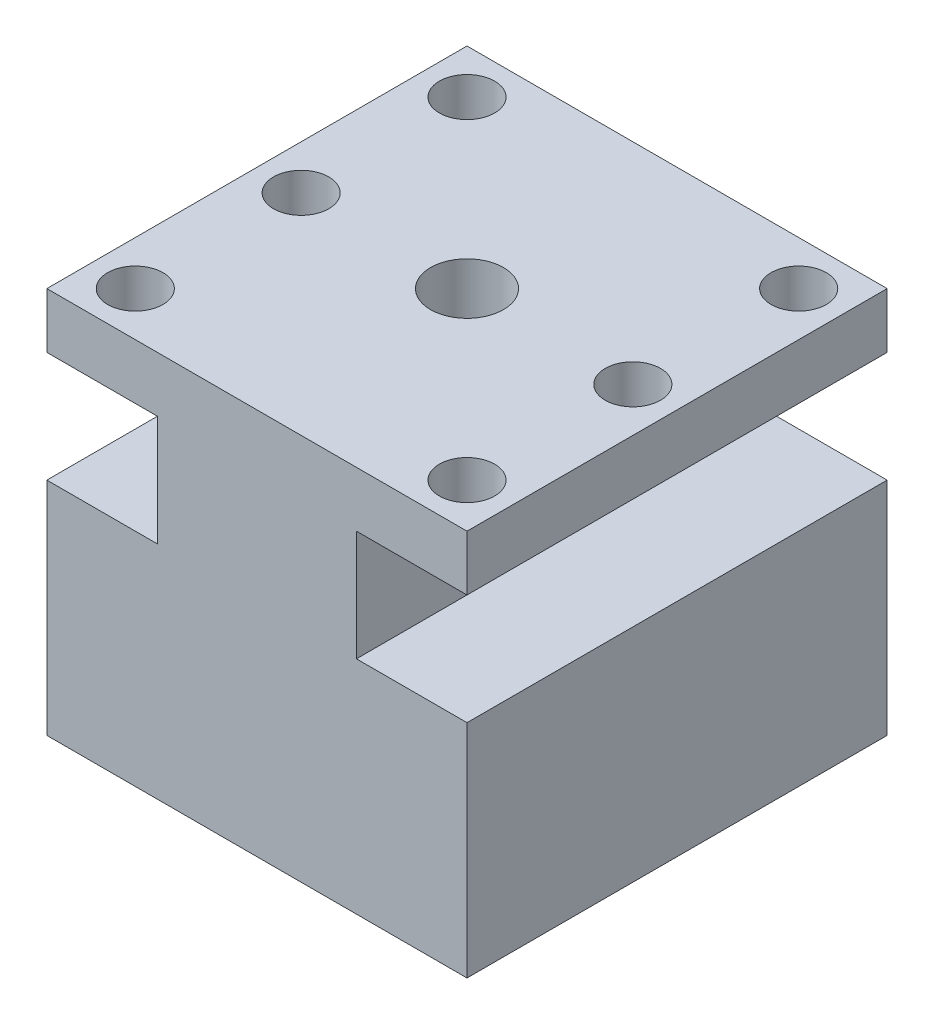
ISO-10303-21;
HEADER;
FILE_DESCRIPTION(('STEP AP214'),'2;1');
FILE_NAME('part.step','',(''),(''),'','','');
FILE_SCHEMA(('AUTOMOTIVE_DESIGN { 1 0 10303 214 1 1 1 1 }'));
ENDSEC;
DATA;
#1=APPLICATION_CONTEXT('core data for automotive mechanical design processes');
#2=APPLICATION_PROTOCOL_DEFINITION('international standard','automotive_design',2000,#1);
#3=PRODUCT_CONTEXT('',#1,'mechanical');
#4=PRODUCT('Part','Part','',(#3));
#5=PRODUCT_RELATED_PRODUCT_CATEGORY('part','',(#4));
#6=PRODUCT_DEFINITION_FORMATION('','',#4);
#7=PRODUCT_DEFINITION_CONTEXT('part definition',#1,'design');
#8=PRODUCT_DEFINITION('design','',#6,#7);
#9=PRODUCT_DEFINITION_SHAPE('','',#8);
#10=(LENGTH_UNIT() NAMED_UNIT(*) SI_UNIT(.MILLI.,.METRE.));
#11=(NAMED_UNIT(*) PLANE_ANGLE_UNIT() SI_UNIT($,.RADIAN.));
#12=(NAMED_UNIT(*) SI_UNIT($,.STERADIAN.) SOLID_ANGLE_UNIT());
#13=UNCERTAINTY_MEASURE_WITH_UNIT(LENGTH_MEASURE(1.E-05),#10,'distance_accuracy_value','');
#14=(GEOMETRIC_REPRESENTATION_CONTEXT(3) GLOBAL_UNCERTAINTY_ASSIGNED_CONTEXT((#13)) GLOBAL_UNIT_ASSIGNED_CONTEXT((#10,
#11,#12)) REPRESENTATION_CONTEXT('',''));
#15=CARTESIAN_POINT('',(0.,0.,0.));
#16=DIRECTION('',(0.,0.,1.));
#17=DIRECTION('',(1.,0.,0.));
#18=AXIS2_PLACEMENT_3D('',#15,#16,#17);
#19=CARTESIAN_POINT('',(0.,20.,0.));
#20=DIRECTION('',(0.,-1.,0.));
#21=DIRECTION('',(0.,0.,-1.));
#22=AXIS2_PLACEMENT_3D('',#19,#20,#21);
#23=PLANE('',#22);
#24=DIRECTION('',(0.,0.,-1.));
#25=VECTOR('',#24,1.);
#26=CARTESIAN_POINT('',(9.,20.,-19.));
#27=LINE('',#26,#25);
#28=CARTESIAN_POINT('',(9.,20.,19.));
#29=VERTEX_POINT('',#28);
#30=CARTESIAN_POINT('',(9.,20.,-19.));
#31=VERTEX_POINT('',#30);
#32=EDGE_CURVE('E58',#29,#31,#27,.T.);
#33=ORIENTED_EDGE('',*,*,#32,.F.);
#34=DIRECTION('',(1.,0.,0.));
#35=VECTOR('',#34,1.);
#36=CARTESIAN_POINT('',(-19.,20.,19.));
#37=LINE('',#36,#35);
#38=CARTESIAN_POINT('',(19.,20.,19.));
#39=VERTEX_POINT('',#38);
#40=EDGE_CURVE('E193',#29,#39,#37,.T.);
#41=ORIENTED_EDGE('',*,*,#40,.T.);
#42=DIRECTION('',(0.,0.,-1.));
#43=VECTOR('',#42,1.);
#44=CARTESIAN_POINT('',(19.,20.,19.));
#45=LINE('',#44,#43);
#46=CARTESIAN_POINT('',(19.,20.,-19.));
#47=VERTEX_POINT('',#46);
#48=EDGE_CURVE('E184',#39,#47,#45,.T.);
#49=ORIENTED_EDGE('',*,*,#48,.T.);
#50=DIRECTION('',(-1.,0.,0.));
#51=VECTOR('',#50,1.);
#52=CARTESIAN_POINT('',(-19.,20.,-19.));
#53=LINE('',#52,#51);
#54=EDGE_CURVE('E189',#47,#31,#53,.T.);
#55=ORIENTED_EDGE('',*,*,#54,.T.);
#56=EDGE_LOOP('',(#33,#41,#49,#55));
#57=FACE_BOUND('',#56,.T.);
#58=ADVANCED_FACE('F43',(#57),#23,.F.);
#59=DIRECTION('',(0.,0.,1.));
#60=VECTOR('',#59,1.);
#61=CARTESIAN_POINT('',(-9.,20.,-19.));
#62=LINE('',#61,#60);
#63=CARTESIAN_POINT('',(-9.,20.,-19.));
#64=VERTEX_POINT('',#63);
#65=CARTESIAN_POINT('',(-9.,20.,19.));
#66=VERTEX_POINT('',#65);
#67=EDGE_CURVE('E66',#64,#66,#62,.T.);
#68=ORIENTED_EDGE('',*,*,#67,.F.);
#69=CARTESIAN_POINT('',(-19.,20.,-19.));
#70=VERTEX_POINT('',#69);
#71=EDGE_CURVE('E187',#64,#70,#53,.T.);
#72=ORIENTED_EDGE('',*,*,#71,.T.);
#73=DIRECTION('',(0.,0.,1.));
#74=VECTOR('',#73,1.);
#75=CARTESIAN_POINT('',(-19.,20.,19.));
#76=LINE('',#75,#74);
#77=CARTESIAN_POINT('',(-19.,20.,19.));
#78=VERTEX_POINT('',#77);
#79=EDGE_CURVE('E191',#70,#78,#76,.T.);
#80=ORIENTED_EDGE('',*,*,#79,.T.);
#81=EDGE_CURVE('E194',#78,#66,#37,.T.);
#82=ORIENTED_EDGE('',*,*,#81,.T.);
#83=EDGE_LOOP('',(#68,#72,#80,#82));
#84=FACE_BOUND('',#83,.T.);
#85=ADVANCED_FACE('F253',(#84),#23,.F.);
#86=CARTESIAN_POINT('',(19.,20.,19.));
#87=DIRECTION('',(-1.,0.,0.));
#88=DIRECTION('',(0.,0.,1.));
#89=AXIS2_PLACEMENT_3D('',#86,#87,#88);
#90=PLANE('',#89);
#91=DIRECTION('',(0.,0.,-1.));
#92=VECTOR('',#91,1.);
#93=CARTESIAN_POINT('',(19.,0.,19.));
#94=LINE('',#93,#92);
#95=CARTESIAN_POINT('',(19.,0.,19.));
#96=VERTEX_POINT('',#95);
#97=CARTESIAN_POINT('',(19.,0.,-19.));
#98=VERTEX_POINT('',#97);
#99=EDGE_CURVE('E183',#96,#98,#94,.T.);
#100=ORIENTED_EDGE('',*,*,#99,.T.);
#101=DIRECTION('',(0.,-1.,0.));
#102=VECTOR('',#101,1.);
#103=CARTESIAN_POINT('',(19.,20.,-19.));
#104=LINE('',#103,#102);
#105=EDGE_CURVE('E11',#47,#98,#104,.T.);
#106=ORIENTED_EDGE('',*,*,#105,.F.);
#107=ORIENTED_EDGE('',*,*,#48,.F.);
#108=DIRECTION('',(0.,-1.,0.));
#109=VECTOR('',#108,1.);
#110=CARTESIAN_POINT('',(19.,20.,19.));
#111=LINE('',#110,#109);
#112=EDGE_CURVE('E196',#39,#96,#111,.T.);
#113=ORIENTED_EDGE('',*,*,#112,.T.);
#114=EDGE_LOOP('',(#100,#106,#107,#113));
#115=FACE_BOUND('',#114,.T.);
#116=ADVANCED_FACE('F45',(#115),#90,.F.);
#117=CARTESIAN_POINT('',(-19.,20.,-19.));
#118=DIRECTION('',(0.,0.,1.));
#119=DIRECTION('',(1.,0.,0.));
#120=AXIS2_PLACEMENT_3D('',#117,#118,#119);
#121=PLANE('',#120);
#122=DIRECTION('',(-1.,0.,0.));
#123=VECTOR('',#122,1.);
#124=CARTESIAN_POINT('',(-19.,0.,-19.));
#125=LINE('',#124,#123);
#126=CARTESIAN_POINT('',(-19.,0.,-19.));
#127=VERTEX_POINT('',#126);
#128=EDGE_CURVE('E199',#98,#127,#125,.T.);
#129=ORIENTED_EDGE('',*,*,#128,.T.);
#130=DIRECTION('',(0.,-1.,0.));
#131=VECTOR('',#130,1.);
#132=CARTESIAN_POINT('',(-19.,20.,-19.));
#133=LINE('',#132,#131);
#134=EDGE_CURVE('E51',#70,#127,#133,.T.);
#135=ORIENTED_EDGE('',*,*,#134,.F.);
#136=ORIENTED_EDGE('',*,*,#71,.F.);
#137=DIRECTION('',(0.,-1.,0.));
#138=VECTOR('',#137,1.);
#139=CARTESIAN_POINT('',(-9.,30.,-19.));
#140=LINE('',#139,#138);
#141=CARTESIAN_POINT('',(-9.,30.,-19.));
#142=VERTEX_POINT('',#141);
#143=EDGE_CURVE('E177',#142,#64,#140,.T.);
#144=ORIENTED_EDGE('',*,*,#143,.F.);
#145=DIRECTION('',(-1.,0.,0.));
#146=VECTOR('',#145,1.);
#147=CARTESIAN_POINT('',(-19.,30.,-19.));
#148=LINE('',#147,#146);
#149=CARTESIAN_POINT('',(-19.,30.,-19.));
#150=VERTEX_POINT('',#149);
#151=EDGE_CURVE('E250',#142,#150,#148,.T.);
#152=ORIENTED_EDGE('',*,*,#151,.T.);
#153=DIRECTION('',(0.,-1.,0.));
#154=VECTOR('',#153,1.);
#155=CARTESIAN_POINT('',(-19.,35.,-19.));
#156=LINE('',#155,#154);
#157=CARTESIAN_POINT('',(-19.,35.,-19.));
#158=VERTEX_POINT('',#157);
#159=EDGE_CURVE('E140',#158,#150,#156,.T.);
#160=ORIENTED_EDGE('',*,*,#159,.F.);
#161=DIRECTION('',(-1.,0.,0.));
#162=VECTOR('',#161,1.);
#163=CARTESIAN_POINT('',(-19.,35.,-19.));
#164=LINE('',#163,#162);
#165=CARTESIAN_POINT('',(19.,35.,-19.));
#166=VERTEX_POINT('',#165);
#167=EDGE_CURVE('E132',#166,#158,#164,.T.);
#168=ORIENTED_EDGE('',*,*,#167,.F.);
#169=DIRECTION('',(0.,-1.,0.));
#170=VECTOR('',#169,1.);
#171=CARTESIAN_POINT('',(19.,35.,-19.));
#172=LINE('',#171,#170);
#173=CARTESIAN_POINT('',(19.,30.,-19.));
#174=VERTEX_POINT('',#173);
#175=EDGE_CURVE('E137',#166,#174,#172,.T.);
#176=ORIENTED_EDGE('',*,*,#175,.T.);
#177=CARTESIAN_POINT('',(9.,30.,-19.));
#178=VERTEX_POINT('',#177);
#179=EDGE_CURVE('E236',#174,#178,#148,.T.);
#180=ORIENTED_EDGE('',*,*,#179,.T.);
#181=DIRECTION('',(0.,-1.,0.));
#182=VECTOR('',#181,1.);
#183=CARTESIAN_POINT('',(9.,30.,-19.));
#184=LINE('',#183,#182);
#185=EDGE_CURVE('E180',#178,#31,#184,.T.);
#186=ORIENTED_EDGE('',*,*,#185,.T.);
#187=ORIENTED_EDGE('',*,*,#54,.F.);
#188=ORIENTED_EDGE('',*,*,#105,.T.);
#189=EDGE_LOOP('',(#129,#135,#136,#144,#152,#160,#168,#176,#180,#186,#187,#188));
#190=FACE_BOUND('',#189,.T.);
#191=ADVANCED_FACE('F134',(#190),#121,.F.);
#192=CARTESIAN_POINT('',(-19.,20.,19.));
#193=DIRECTION('',(1.,0.,0.));
#194=DIRECTION('',(0.,0.,-1.));
#195=AXIS2_PLACEMENT_3D('',#192,#193,#194);
#196=PLANE('',#195);
#197=DIRECTION('',(0.,0.,1.));
#198=VECTOR('',#197,1.);
#199=CARTESIAN_POINT('',(-19.,0.,19.));
#200=LINE('',#199,#198);
#201=CARTESIAN_POINT('',(-19.,0.,19.));
#202=VERTEX_POINT('',#201);
#203=EDGE_CURVE('E201',#127,#202,#200,.T.);
#204=ORIENTED_EDGE('',*,*,#203,.T.);
#205=DIRECTION('',(0.,-1.,0.));
#206=VECTOR('',#205,1.);
#207=CARTESIAN_POINT('',(-19.,20.,19.));
#208=LINE('',#207,#206);
#209=EDGE_CURVE('E206',#78,#202,#208,.T.);
#210=ORIENTED_EDGE('',*,*,#209,.F.);
#211=ORIENTED_EDGE('',*,*,#79,.F.);
#212=ORIENTED_EDGE('',*,*,#134,.T.);
#213=EDGE_LOOP('',(#204,#210,#211,#212));
#214=FACE_BOUND('',#213,.T.);
#215=ADVANCED_FACE('F213',(#214),#196,.F.);
#216=CARTESIAN_POINT('',(-19.,20.,19.));
#217=DIRECTION('',(0.,0.,-1.));
#218=DIRECTION('',(-1.,0.,0.));
#219=AXIS2_PLACEMENT_3D('',#216,#217,#218);
#220=PLANE('',#219);
#221=DIRECTION('',(1.,0.,0.));
#222=VECTOR('',#221,1.);
#223=CARTESIAN_POINT('',(-19.,0.,19.));
#224=LINE('',#223,#222);
#225=EDGE_CURVE('E188',#202,#96,#224,.T.);
#226=ORIENTED_EDGE('',*,*,#225,.T.);
#227=ORIENTED_EDGE('',*,*,#112,.F.);
#228=ORIENTED_EDGE('',*,*,#40,.F.);
#229=DIRECTION('',(0.,-1.,0.));
#230=VECTOR('',#229,1.);
#231=CARTESIAN_POINT('',(9.,30.,19.));
#232=LINE('',#231,#230);
#233=CARTESIAN_POINT('',(9.,30.,19.));
#234=VERTEX_POINT('',#233);
#235=EDGE_CURVE('E169',#234,#29,#232,.T.);
#236=ORIENTED_EDGE('',*,*,#235,.F.);
#237=DIRECTION('',(1.,0.,0.));
#238=VECTOR('',#237,1.);
#239=CARTESIAN_POINT('',(-19.,30.,19.));
#240=LINE('',#239,#238);
#241=CARTESIAN_POINT('',(19.,30.,19.));
#242=VERTEX_POINT('',#241);
#243=EDGE_CURVE('E231',#234,#242,#240,.T.);
#244=ORIENTED_EDGE('',*,*,#243,.T.);
#245=DIRECTION('',(0.,-1.,0.));
#246=VECTOR('',#245,1.);
#247=CARTESIAN_POINT('',(19.,35.,19.));
#248=LINE('',#247,#246);
#249=CARTESIAN_POINT('',(19.,35.,19.));
#250=VERTEX_POINT('',#249);
#251=EDGE_CURVE('E240',#250,#242,#248,.T.);
#252=ORIENTED_EDGE('',*,*,#251,.F.);
#253=DIRECTION('',(1.,0.,0.));
#254=VECTOR('',#253,1.);
#255=CARTESIAN_POINT('',(-19.,35.,19.));
#256=LINE('',#255,#254);
#257=CARTESIAN_POINT('',(-19.,35.,19.));
#258=VERTEX_POINT('',#257);
#259=EDGE_CURVE('E149',#258,#250,#256,.T.);
#260=ORIENTED_EDGE('',*,*,#259,.F.);
#261=DIRECTION('',(0.,-1.,0.));
#262=VECTOR('',#261,1.);
#263=CARTESIAN_POINT('',(-19.,35.,19.));
#264=LINE('',#263,#262);
#265=CARTESIAN_POINT('',(-19.,30.,19.));
#266=VERTEX_POINT('',#265);
#267=EDGE_CURVE('E160',#258,#266,#264,.T.);
#268=ORIENTED_EDGE('',*,*,#267,.T.);
#269=CARTESIAN_POINT('',(-9.,30.,19.));
#270=VERTEX_POINT('',#269);
#271=EDGE_CURVE('E153',#266,#270,#240,.T.);
#272=ORIENTED_EDGE('',*,*,#271,.T.);
#273=DIRECTION('',(0.,-1.,0.));
#274=VECTOR('',#273,1.);
#275=CARTESIAN_POINT('',(-9.,30.,19.));
#276=LINE('',#275,#274);
#277=EDGE_CURVE('E174',#270,#66,#276,.T.);
#278=ORIENTED_EDGE('',*,*,#277,.T.);
#279=ORIENTED_EDGE('',*,*,#81,.F.);
#280=ORIENTED_EDGE('',*,*,#209,.T.);
#281=EDGE_LOOP('',(#226,#227,#228,#236,#244,#252,#260,#268,#272,#278,#279,#280));
#282=FACE_BOUND('',#281,.T.);
#283=ADVANCED_FACE('F221',(#282),#220,.F.);
#284=CARTESIAN_POINT('',(0.,0.,0.));
#285=DIRECTION('',(0.,-1.,0.));
#286=DIRECTION('',(0.,0.,-1.));
#287=AXIS2_PLACEMENT_3D('',#284,#285,#286);
#288=PLANE('',#287);
#289=CARTESIAN_POINT('',(0.,0.,0.));
#290=DIRECTION('',(0.,1.,0.));
#291=DIRECTION('',(0.,0.,1.));
#292=AXIS2_PLACEMENT_3D('',#289,#290,#291);
#293=CIRCLE('',#292,3.3);
#294=CARTESIAN_POINT('',(0.,0.,3.3));
#295=VERTEX_POINT('',#294);
#296=EDGE_CURVE('E297',#295,#295,#293,.T.);
#297=ORIENTED_EDGE('',*,*,#296,.T.);
#298=EDGE_LOOP('',(#297));
#299=FACE_BOUND('',#298,.T.);
#300=ORIENTED_EDGE('',*,*,#99,.F.);
#301=ORIENTED_EDGE('',*,*,#225,.F.);
#302=ORIENTED_EDGE('',*,*,#203,.F.);
#303=ORIENTED_EDGE('',*,*,#128,.F.);
#304=EDGE_LOOP('',(#300,#301,#302,#303));
#305=FACE_BOUND('',#304,.T.);
#306=ADVANCED_FACE('F218',(#299,#305),#288,.T.);
#307=CARTESIAN_POINT('',(9.,30.,-19.));
#308=DIRECTION('',(-1.,0.,0.));
#309=DIRECTION('',(0.,0.,1.));
#310=AXIS2_PLACEMENT_3D('',#307,#308,#309);
#311=PLANE('',#310);
#312=ORIENTED_EDGE('',*,*,#32,.T.);
#313=ORIENTED_EDGE('',*,*,#185,.F.);
#314=DIRECTION('',(0.,0.,-1.));
#315=VECTOR('',#314,1.);
#316=CARTESIAN_POINT('',(9.,30.,-19.));
#317=LINE('',#316,#315);
#318=EDGE_CURVE('E164',#234,#178,#317,.T.);
#319=ORIENTED_EDGE('',*,*,#318,.F.);
#320=ORIENTED_EDGE('',*,*,#235,.T.);
#321=EDGE_LOOP('',(#312,#313,#319,#320));
#322=FACE_BOUND('',#321,.T.);
#323=ADVANCED_FACE('F228',(#322),#311,.F.);
#324=CARTESIAN_POINT('',(-9.,30.,-19.));
#325=DIRECTION('',(1.,0.,0.));
#326=DIRECTION('',(0.,0.,-1.));
#327=AXIS2_PLACEMENT_3D('',#324,#325,#326);
#328=PLANE('',#327);
#329=ORIENTED_EDGE('',*,*,#67,.T.);
#330=ORIENTED_EDGE('',*,*,#277,.F.);
#331=DIRECTION('',(0.,0.,1.));
#332=VECTOR('',#331,1.);
#333=CARTESIAN_POINT('',(-9.,30.,-19.));
#334=LINE('',#333,#332);
#335=EDGE_CURVE('E167',#142,#270,#334,.T.);
#336=ORIENTED_EDGE('',*,*,#335,.F.);
#337=ORIENTED_EDGE('',*,*,#143,.T.);
#338=EDGE_LOOP('',(#329,#330,#336,#337));
#339=FACE_BOUND('',#338,.T.);
#340=ADVANCED_FACE('F252',(#339),#328,.F.);
#341=CARTESIAN_POINT('',(0.,30.,0.));
#342=DIRECTION('',(0.,1.,0.));
#343=DIRECTION('',(0.,0.,1.));
#344=AXIS2_PLACEMENT_3D('',#341,#342,#343);
#345=PLANE('',#344);
#346=CARTESIAN_POINT('',(15.,30.,-15.));
#347=DIRECTION('',(0.,1.,0.));
#348=DIRECTION('',(0.,0.,1.));
#349=AXIS2_PLACEMENT_3D('',#346,#347,#348);
#350=CIRCLE('',#349,2.5);
#351=CARTESIAN_POINT('',(15.,30.,-12.5));
#352=VERTEX_POINT('',#351);
#353=EDGE_CURVE('E273',#352,#352,#350,.T.);
#354=ORIENTED_EDGE('',*,*,#353,.T.);
#355=EDGE_LOOP('',(#354));
#356=FACE_BOUND('',#355,.T.);
#357=CARTESIAN_POINT('',(15.,30.,0.));
#358=DIRECTION('',(0.,1.,0.));
#359=DIRECTION('',(0.,0.,1.));
#360=AXIS2_PLACEMENT_3D('',#357,#358,#359);
#361=CIRCLE('',#360,2.5);
#362=CARTESIAN_POINT('',(15.,30.,2.5));
#363=VERTEX_POINT('',#362);
#364=EDGE_CURVE('E265',#363,#363,#361,.T.);
#365=ORIENTED_EDGE('',*,*,#364,.T.);
#366=EDGE_LOOP('',(#365));
#367=FACE_BOUND('',#366,.T.);
#368=CARTESIAN_POINT('',(15.,30.,15.));
#369=DIRECTION('',(0.,1.,0.));
#370=DIRECTION('',(0.,0.,1.));
#371=AXIS2_PLACEMENT_3D('',#368,#369,#370);
#372=CIRCLE('',#371,2.5);
#373=CARTESIAN_POINT('',(15.,30.,17.5));
#374=VERTEX_POINT('',#373);
#375=EDGE_CURVE('E258',#374,#374,#372,.T.);
#376=ORIENTED_EDGE('',*,*,#375,.T.);
#377=EDGE_LOOP('',(#376));
#378=FACE_BOUND('',#377,.T.);
#379=ORIENTED_EDGE('',*,*,#243,.F.);
#380=ORIENTED_EDGE('',*,*,#318,.T.);
#381=ORIENTED_EDGE('',*,*,#179,.F.);
#382=DIRECTION('',(0.,0.,-1.));
#383=VECTOR('',#382,1.);
#384=CARTESIAN_POINT('',(19.,30.,-19.));
#385=LINE('',#384,#383);
#386=EDGE_CURVE('E157',#242,#174,#385,.T.);
#387=ORIENTED_EDGE('',*,*,#386,.F.);
#388=EDGE_LOOP('',(#379,#380,#381,#387));
#389=FACE_BOUND('',#388,.T.);
#390=ADVANCED_FACE('F232',(#356,#367,#378,#389),#345,.F.);
#391=CARTESIAN_POINT('',(-15.,30.,-15.));
#392=DIRECTION('',(0.,1.,0.));
#393=DIRECTION('',(0.,0.,1.));
#394=AXIS2_PLACEMENT_3D('',#391,#392,#393);
#395=CIRCLE('',#394,2.5);
#396=CARTESIAN_POINT('',(-15.,30.,-12.5));
#397=VERTEX_POINT('',#396);
#398=EDGE_CURVE('E291',#397,#397,#395,.T.);
#399=ORIENTED_EDGE('',*,*,#398,.T.);
#400=EDGE_LOOP('',(#399));
#401=FACE_BOUND('',#400,.T.);
#402=CARTESIAN_POINT('',(-15.,30.,0.));
#403=DIRECTION('',(0.,1.,0.));
#404=DIRECTION('',(0.,0.,1.));
#405=AXIS2_PLACEMENT_3D('',#402,#403,#404);
#406=CIRCLE('',#405,2.5);
#407=CARTESIAN_POINT('',(-15.,30.,2.5));
#408=VERTEX_POINT('',#407);
#409=EDGE_CURVE('E285',#408,#408,#406,.T.);
#410=ORIENTED_EDGE('',*,*,#409,.T.);
#411=EDGE_LOOP('',(#410));
#412=FACE_BOUND('',#411,.T.);
#413=CARTESIAN_POINT('',(-15.,30.,15.));
#414=DIRECTION('',(0.,1.,0.));
#415=DIRECTION('',(0.,0.,1.));
#416=AXIS2_PLACEMENT_3D('',#413,#414,#415);
#417=CIRCLE('',#416,2.5);
#418=CARTESIAN_POINT('',(-15.,30.,17.5));
#419=VERTEX_POINT('',#418);
#420=EDGE_CURVE('E279',#419,#419,#417,.T.);
#421=ORIENTED_EDGE('',*,*,#420,.T.);
#422=EDGE_LOOP('',(#421));
#423=FACE_BOUND('',#422,.T.);
#424=ORIENTED_EDGE('',*,*,#151,.F.);
#425=ORIENTED_EDGE('',*,*,#335,.T.);
#426=ORIENTED_EDGE('',*,*,#271,.F.);
#427=DIRECTION('',(0.,0.,1.));
#428=VECTOR('',#427,1.);
#429=CARTESIAN_POINT('',(-19.,30.,-19.));
#430=LINE('',#429,#428);
#431=EDGE_CURVE('E233',#150,#266,#430,.T.);
#432=ORIENTED_EDGE('',*,*,#431,.F.);
#433=EDGE_LOOP('',(#424,#425,#426,#432));
#434=FACE_BOUND('',#433,.T.);
#435=ADVANCED_FACE('F248',(#401,#412,#423,#434),#345,.F.);
#436=CARTESIAN_POINT('',(19.,35.,-19.));
#437=DIRECTION('',(-1.,0.,0.));
#438=DIRECTION('',(0.,0.,1.));
#439=AXIS2_PLACEMENT_3D('',#436,#437,#438);
#440=PLANE('',#439);
#441=ORIENTED_EDGE('',*,*,#386,.T.);
#442=ORIENTED_EDGE('',*,*,#175,.F.);
#443=DIRECTION('',(0.,0.,-1.));
#444=VECTOR('',#443,1.);
#445=CARTESIAN_POINT('',(19.,35.,-19.));
#446=LINE('',#445,#444);
#447=EDGE_CURVE('E144',#250,#166,#446,.T.);
#448=ORIENTED_EDGE('',*,*,#447,.F.);
#449=ORIENTED_EDGE('',*,*,#251,.T.);
#450=EDGE_LOOP('',(#441,#442,#448,#449));
#451=FACE_BOUND('',#450,.T.);
#452=ADVANCED_FACE('F155',(#451),#440,.F.);
#453=CARTESIAN_POINT('',(-19.,35.,-19.));
#454=DIRECTION('',(1.,0.,0.));
#455=DIRECTION('',(0.,0.,-1.));
#456=AXIS2_PLACEMENT_3D('',#453,#454,#455);
#457=PLANE('',#456);
#458=ORIENTED_EDGE('',*,*,#431,.T.);
#459=ORIENTED_EDGE('',*,*,#267,.F.);
#460=DIRECTION('',(0.,0.,1.));
#461=VECTOR('',#460,1.);
#462=CARTESIAN_POINT('',(-19.,35.,-19.));
#463=LINE('',#462,#461);
#464=EDGE_CURVE('E143',#158,#258,#463,.T.);
#465=ORIENTED_EDGE('',*,*,#464,.F.);
#466=ORIENTED_EDGE('',*,*,#159,.T.);
#467=EDGE_LOOP('',(#458,#459,#465,#466));
#468=FACE_BOUND('',#467,.T.);
#469=ADVANCED_FACE('F254',(#468),#457,.F.);
#470=CARTESIAN_POINT('',(0.,35.,0.));
#471=DIRECTION('',(0.,1.,0.));
#472=DIRECTION('',(0.,0.,1.));
#473=AXIS2_PLACEMENT_3D('',#470,#471,#472);
#474=PLANE('',#473);
#475=CARTESIAN_POINT('',(0.,35.,0.));
#476=DIRECTION('',(0.,1.,0.));
#477=DIRECTION('',(0.,0.,1.));
#478=AXIS2_PLACEMENT_3D('',#475,#476,#477);
#479=CIRCLE('',#478,3.3);
#480=CARTESIAN_POINT('',(0.,35.,3.3));
#481=VERTEX_POINT('',#480);
#482=EDGE_CURVE('E300',#481,#481,#479,.T.);
#483=ORIENTED_EDGE('',*,*,#482,.F.);
#484=EDGE_LOOP('',(#483));
#485=FACE_BOUND('',#484,.T.);
#486=CARTESIAN_POINT('',(-15.,35.,-15.));
#487=DIRECTION('',(0.,1.,0.));
#488=DIRECTION('',(0.,0.,1.));
#489=AXIS2_PLACEMENT_3D('',#486,#487,#488);
#490=CIRCLE('',#489,2.5);
#491=CARTESIAN_POINT('',(-15.,35.,-12.5));
#492=VERTEX_POINT('',#491);
#493=EDGE_CURVE('E294',#492,#492,#490,.T.);
#494=ORIENTED_EDGE('',*,*,#493,.F.);
#495=EDGE_LOOP('',(#494));
#496=FACE_BOUND('',#495,.T.);
#497=CARTESIAN_POINT('',(-15.,35.,0.));
#498=DIRECTION('',(0.,1.,0.));
#499=DIRECTION('',(0.,0.,1.));
#500=AXIS2_PLACEMENT_3D('',#497,#498,#499);
#501=CIRCLE('',#500,2.5);
#502=CARTESIAN_POINT('',(-15.,35.,2.5));
#503=VERTEX_POINT('',#502);
#504=EDGE_CURVE('E288',#503,#503,#501,.T.);
#505=ORIENTED_EDGE('',*,*,#504,.F.);
#506=EDGE_LOOP('',(#505));
#507=FACE_BOUND('',#506,.T.);
#508=CARTESIAN_POINT('',(-15.,35.,15.));
#509=DIRECTION('',(0.,1.,0.));
#510=DIRECTION('',(0.,0.,1.));
#511=AXIS2_PLACEMENT_3D('',#508,#509,#510);
#512=CIRCLE('',#511,2.5);
#513=CARTESIAN_POINT('',(-15.,35.,17.5));
#514=VERTEX_POINT('',#513);
#515=EDGE_CURVE('E282',#514,#514,#512,.T.);
#516=ORIENTED_EDGE('',*,*,#515,.F.);
#517=EDGE_LOOP('',(#516));
#518=FACE_BOUND('',#517,.T.);
#519=CARTESIAN_POINT('',(15.,35.,-15.));
#520=DIRECTION('',(0.,1.,0.));
#521=DIRECTION('',(0.,0.,1.));
#522=AXIS2_PLACEMENT_3D('',#519,#520,#521);
#523=CIRCLE('',#522,2.5);
#524=CARTESIAN_POINT('',(15.,35.,-12.5));
#525=VERTEX_POINT('',#524);
#526=EDGE_CURVE('E276',#525,#525,#523,.T.);
#527=ORIENTED_EDGE('',*,*,#526,.F.);
#528=EDGE_LOOP('',(#527));
#529=FACE_BOUND('',#528,.T.);
#530=CARTESIAN_POINT('',(15.,35.,0.));
#531=DIRECTION('',(0.,1.,0.));
#532=DIRECTION('',(0.,0.,1.));
#533=AXIS2_PLACEMENT_3D('',#530,#531,#532);
#534=CIRCLE('',#533,2.5);
#535=CARTESIAN_POINT('',(15.,35.,2.5));
#536=VERTEX_POINT('',#535);
#537=EDGE_CURVE('E270',#536,#536,#534,.T.);
#538=ORIENTED_EDGE('',*,*,#537,.F.);
#539=EDGE_LOOP('',(#538));
#540=FACE_BOUND('',#539,.T.);
#541=CARTESIAN_POINT('',(15.,35.,15.));
#542=DIRECTION('',(0.,1.,0.));
#543=DIRECTION('',(0.,0.,1.));
#544=AXIS2_PLACEMENT_3D('',#541,#542,#543);
#545=CIRCLE('',#544,2.5);
#546=CARTESIAN_POINT('',(15.,35.,17.5));
#547=VERTEX_POINT('',#546);
#548=EDGE_CURVE('E260',#547,#547,#545,.T.);
#549=ORIENTED_EDGE('',*,*,#548,.F.);
#550=EDGE_LOOP('',(#549));
#551=FACE_BOUND('',#550,.T.);
#552=ORIENTED_EDGE('',*,*,#447,.T.);
#553=ORIENTED_EDGE('',*,*,#167,.T.);
#554=ORIENTED_EDGE('',*,*,#464,.T.);
#555=ORIENTED_EDGE('',*,*,#259,.T.);
#556=EDGE_LOOP('',(#552,#553,#554,#555));
#557=FACE_BOUND('',#556,.T.);
#558=ADVANCED_FACE('F147',(#485,#496,#507,#518,#529,#540,#551,#557),#474,.T.);
#559=CARTESIAN_POINT('',(15.,35.,15.));
#560=DIRECTION('',(0.,1.,0.));
#561=DIRECTION('',(0.,0.,1.));
#562=AXIS2_PLACEMENT_3D('',#559,#560,#561);
#563=CYLINDRICAL_SURFACE('',#562,2.5);
#564=ORIENTED_EDGE('',*,*,#375,.F.);
#565=EDGE_LOOP('',(#564));
#566=FACE_BOUND('',#565,.T.);
#567=ORIENTED_EDGE('',*,*,#548,.T.);
#568=EDGE_LOOP('',(#567));
#569=FACE_BOUND('',#568,.T.);
#570=ADVANCED_FACE('F308',(#566,#569),#563,.F.);
#571=CARTESIAN_POINT('',(15.,35.,0.));
#572=DIRECTION('',(0.,1.,0.));
#573=DIRECTION('',(0.,0.,1.));
#574=AXIS2_PLACEMENT_3D('',#571,#572,#573);
#575=CYLINDRICAL_SURFACE('',#574,2.5);
#576=ORIENTED_EDGE('',*,*,#364,.F.);
#577=EDGE_LOOP('',(#576));
#578=FACE_BOUND('',#577,.T.);
#579=ORIENTED_EDGE('',*,*,#537,.T.);
#580=EDGE_LOOP('',(#579));
#581=FACE_BOUND('',#580,.T.);
#582=ADVANCED_FACE('F323',(#578,#581),#575,.F.);
#583=CARTESIAN_POINT('',(15.,35.,-15.));
#584=DIRECTION('',(0.,1.,0.));
#585=DIRECTION('',(0.,0.,1.));
#586=AXIS2_PLACEMENT_3D('',#583,#584,#585);
#587=CYLINDRICAL_SURFACE('',#586,2.5);
#588=ORIENTED_EDGE('',*,*,#353,.F.);
#589=EDGE_LOOP('',(#588));
#590=FACE_BOUND('',#589,.T.);
#591=ORIENTED_EDGE('',*,*,#526,.T.);
#592=EDGE_LOOP('',(#591));
#593=FACE_BOUND('',#592,.T.);
#594=ADVANCED_FACE('F329',(#590,#593),#587,.F.);
#595=CARTESIAN_POINT('',(-15.,35.,15.));
#596=DIRECTION('',(0.,1.,0.));
#597=DIRECTION('',(0.,0.,1.));
#598=AXIS2_PLACEMENT_3D('',#595,#596,#597);
#599=CYLINDRICAL_SURFACE('',#598,2.5);
#600=ORIENTED_EDGE('',*,*,#420,.F.);
#601=EDGE_LOOP('',(#600));
#602=FACE_BOUND('',#601,.T.);
#603=ORIENTED_EDGE('',*,*,#515,.T.);
#604=EDGE_LOOP('',(#603));
#605=FACE_BOUND('',#604,.T.);
#606=ADVANCED_FACE('F455',(#602,#605),#599,.F.);
#607=CARTESIAN_POINT('',(-15.,35.,0.));
#608=DIRECTION('',(0.,1.,0.));
#609=DIRECTION('',(0.,0.,1.));
#610=AXIS2_PLACEMENT_3D('',#607,#608,#609);
#611=CYLINDRICAL_SURFACE('',#610,2.5);
#612=ORIENTED_EDGE('',*,*,#409,.F.);
#613=EDGE_LOOP('',(#612));
#614=FACE_BOUND('',#613,.T.);
#615=ORIENTED_EDGE('',*,*,#504,.T.);
#616=EDGE_LOOP('',(#615));
#617=FACE_BOUND('',#616,.T.);
#618=ADVANCED_FACE('F468',(#614,#617),#611,.F.);
#619=CARTESIAN_POINT('',(-15.,35.,-15.));
#620=DIRECTION('',(0.,1.,0.));
#621=DIRECTION('',(0.,0.,1.));
#622=AXIS2_PLACEMENT_3D('',#619,#620,#621);
#623=CYLINDRICAL_SURFACE('',#622,2.5);
#624=ORIENTED_EDGE('',*,*,#398,.F.);
#625=EDGE_LOOP('',(#624));
#626=FACE_BOUND('',#625,.T.);
#627=ORIENTED_EDGE('',*,*,#493,.T.);
#628=EDGE_LOOP('',(#627));
#629=FACE_BOUND('',#628,.T.);
#630=ADVANCED_FACE('F481',(#626,#629),#623,.F.);
#631=CARTESIAN_POINT('',(0.,35.,0.));
#632=DIRECTION('',(0.,1.,0.));
#633=DIRECTION('',(0.,0.,1.));
#634=AXIS2_PLACEMENT_3D('',#631,#632,#633);
#635=CYLINDRICAL_SURFACE('',#634,3.3);
#636=ORIENTED_EDGE('',*,*,#296,.F.);
#637=EDGE_LOOP('',(#636));
#638=FACE_BOUND('',#637,.T.);
#639=ORIENTED_EDGE('',*,*,#482,.T.);
#640=EDGE_LOOP('',(#639));
#641=FACE_BOUND('',#640,.T.);
#642=ADVANCED_FACE('F304',(#638,#641),#635,.F.);
#643=CLOSED_SHELL('',(#58,#85,#116,#191,#215,#283,#306,#323,#340,#390,#435,#452,#469,#558,#570,
#582,#594,#606,#618,#630,#642));
#644=MANIFOLD_SOLID_BREP('B2',#643);
#645=ADVANCED_BREP_SHAPE_REPRESENTATION('',(#18,#644),#14);
#646=SHAPE_DEFINITION_REPRESENTATION(#9,#645);
ENDSEC;
END-ISO-10303-21;
